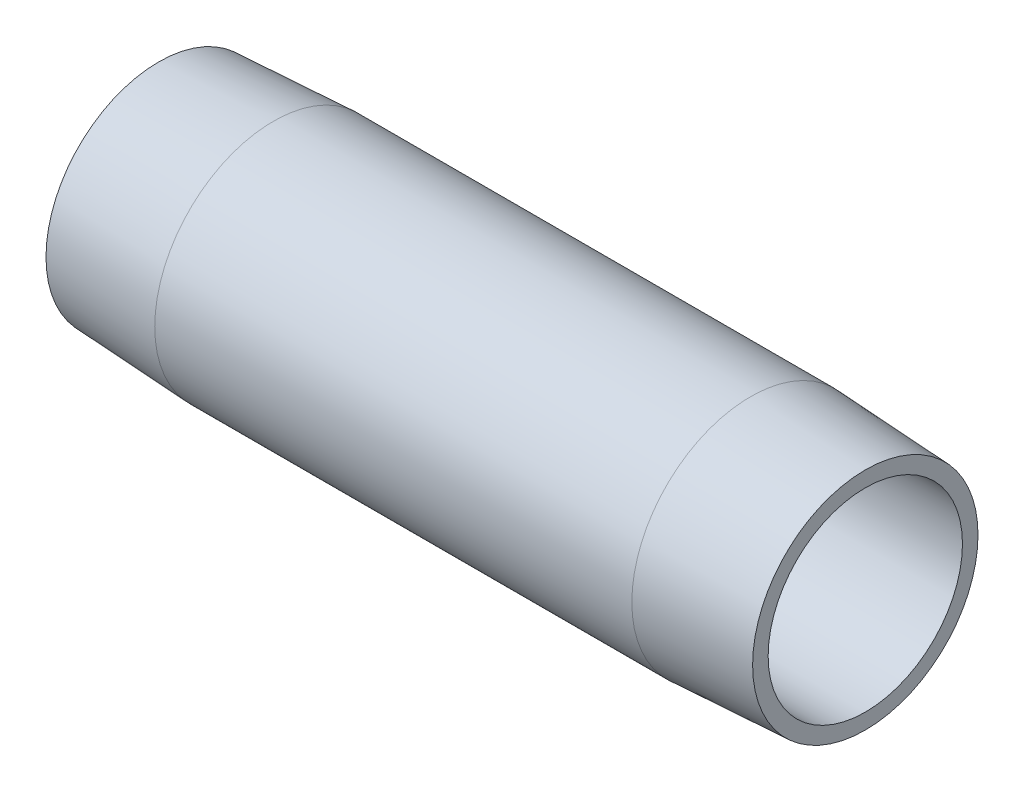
ISO-10303-21;
HEADER;
FILE_DESCRIPTION(('STEP AP214'),'2;1');
FILE_NAME('part.step','',(''),(''),'','','');
FILE_SCHEMA(('AUTOMOTIVE_DESIGN { 1 0 10303 214 1 1 1 1 }'));
ENDSEC;
DATA;
#1=APPLICATION_CONTEXT('core data for automotive mechanical design processes');
#2=APPLICATION_PROTOCOL_DEFINITION('international standard','automotive_design',2000,#1);
#3=PRODUCT_CONTEXT('',#1,'mechanical');
#4=PRODUCT('Part','Part','',(#3));
#5=PRODUCT_RELATED_PRODUCT_CATEGORY('part','',(#4));
#6=PRODUCT_DEFINITION_FORMATION('','',#4);
#7=PRODUCT_DEFINITION_CONTEXT('part definition',#1,'design');
#8=PRODUCT_DEFINITION('design','',#6,#7);
#9=PRODUCT_DEFINITION_SHAPE('','',#8);
#10=(LENGTH_UNIT() NAMED_UNIT(*) SI_UNIT(.MILLI.,.METRE.));
#11=(NAMED_UNIT(*) PLANE_ANGLE_UNIT() SI_UNIT($,.RADIAN.));
#12=(NAMED_UNIT(*) SI_UNIT($,.STERADIAN.) SOLID_ANGLE_UNIT());
#13=UNCERTAINTY_MEASURE_WITH_UNIT(LENGTH_MEASURE(1.E-05),#10,'distance_accuracy_value','');
#14=(GEOMETRIC_REPRESENTATION_CONTEXT(3) GLOBAL_UNCERTAINTY_ASSIGNED_CONTEXT((#13)) GLOBAL_UNIT_ASSIGNED_CONTEXT((#10,
#11,#12)) REPRESENTATION_CONTEXT('',''));
#15=CARTESIAN_POINT('',(0.,0.,0.));
#16=DIRECTION('',(0.,0.,1.));
#17=DIRECTION('',(1.,0.,0.));
#18=AXIS2_PLACEMENT_3D('',#15,#16,#17);
#19=CARTESIAN_POINT('',(63.5,8.73125,0.));
#20=DIRECTION('',(-1.,0.,0.));
#21=DIRECTION('',(0.,0.,1.));
#22=AXIS2_PLACEMENT_3D('',#19,#20,#21);
#23=PLANE('',#22);
#24=CARTESIAN_POINT('',(63.5,0.,0.));
#25=DIRECTION('',(-1.,0.,0.));
#26=DIRECTION('',(0.,0.,1.));
#27=AXIS2_PLACEMENT_3D('',#24,#25,#26);
#28=CIRCLE('',#27,10.1275500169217);
#29=CARTESIAN_POINT('',(63.5,0.,10.1275500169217));
#30=VERTEX_POINT('',#29);
#31=EDGE_CURVE('E10',#30,#30,#28,.T.);
#32=ORIENTED_EDGE('',*,*,#31,.F.);
#33=EDGE_LOOP('',(#32));
#34=FACE_BOUND('',#33,.T.);
#35=CARTESIAN_POINT('',(63.5,0.,0.));
#36=DIRECTION('',(-1.,0.,0.));
#37=DIRECTION('',(0.,0.,1.));
#38=AXIS2_PLACEMENT_3D('',#35,#36,#37);
#39=CIRCLE('',#38,8.73125);
#40=CARTESIAN_POINT('',(63.5,0.,8.73125));
#41=VERTEX_POINT('',#40);
#42=EDGE_CURVE('E52',#41,#41,#39,.T.);
#43=ORIENTED_EDGE('',*,*,#42,.T.);
#44=EDGE_LOOP('',(#43));
#45=FACE_BOUND('',#44,.T.);
#46=ADVANCED_FACE('F30',(#34,#45),#23,.F.);
#47=CARTESIAN_POINT('',(63.5,0.,0.));
#48=DIRECTION('',(-1.,0.,0.));
#49=DIRECTION('',(0.,0.,1.));
#50=AXIS2_PLACEMENT_3D('',#47,#48,#49);
#51=CONICAL_SURFACE('',#50,10.1275500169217,0.0523598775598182);
#52=CARTESIAN_POINT('',(53.1876,0.,0.));
#53=DIRECTION('',(-1.,0.,0.));
#54=DIRECTION('',(0.,0.,1.));
#55=AXIS2_PLACEMENT_3D('',#52,#53,#54);
#56=CIRCLE('',#55,10.668);
#57=CARTESIAN_POINT('',(53.1876,0.,10.668));
#58=VERTEX_POINT('',#57);
#59=EDGE_CURVE('E36',#58,#58,#56,.T.);
#60=ORIENTED_EDGE('',*,*,#59,.F.);
#61=EDGE_LOOP('',(#60));
#62=FACE_BOUND('',#61,.T.);
#63=ORIENTED_EDGE('',*,*,#31,.T.);
#64=EDGE_LOOP('',(#63));
#65=FACE_BOUND('',#64,.T.);
#66=ADVANCED_FACE('F77',(#62,#65),#51,.T.);
#67=CARTESIAN_POINT('',(0.,0.,0.));
#68=DIRECTION('',(-1.,0.,0.));
#69=DIRECTION('',(0.,0.,1.));
#70=AXIS2_PLACEMENT_3D('',#67,#68,#69);
#71=CYLINDRICAL_SURFACE('',#70,10.668);
#72=CARTESIAN_POINT('',(10.3124,0.,0.));
#73=DIRECTION('',(-1.,0.,0.));
#74=DIRECTION('',(0.,0.,1.));
#75=AXIS2_PLACEMENT_3D('',#72,#73,#74);
#76=CIRCLE('',#75,10.668);
#77=CARTESIAN_POINT('',(10.3124,0.,10.668));
#78=VERTEX_POINT('',#77);
#79=EDGE_CURVE('E40',#78,#78,#76,.T.);
#80=ORIENTED_EDGE('',*,*,#79,.F.);
#81=EDGE_LOOP('',(#80));
#82=FACE_BOUND('',#81,.T.);
#83=ORIENTED_EDGE('',*,*,#59,.T.);
#84=EDGE_LOOP('',(#83));
#85=FACE_BOUND('',#84,.T.);
#86=ADVANCED_FACE('F72',(#82,#85),#71,.T.);
#87=CARTESIAN_POINT('',(10.3124,0.,0.));
#88=DIRECTION('',(1.,0.,0.));
#89=DIRECTION('',(0.,0.,-1.));
#90=AXIS2_PLACEMENT_3D('',#87,#88,#89);
#91=CONICAL_SURFACE('',#90,10.668,0.0523598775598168);
#92=CARTESIAN_POINT('',(0.,0.,0.));
#93=DIRECTION('',(-1.,0.,0.));
#94=DIRECTION('',(0.,0.,1.));
#95=AXIS2_PLACEMENT_3D('',#92,#93,#94);
#96=CIRCLE('',#95,10.1275500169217);
#97=CARTESIAN_POINT('',(0.,0.,10.1275500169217));
#98=VERTEX_POINT('',#97);
#99=EDGE_CURVE('E44',#98,#98,#96,.T.);
#100=ORIENTED_EDGE('',*,*,#99,.F.);
#101=EDGE_LOOP('',(#100));
#102=FACE_BOUND('',#101,.T.);
#103=ORIENTED_EDGE('',*,*,#79,.T.);
#104=EDGE_LOOP('',(#103));
#105=FACE_BOUND('',#104,.T.);
#106=ADVANCED_FACE('F66',(#102,#105),#91,.T.);
#107=CARTESIAN_POINT('',(0.,10.1275500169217,0.));
#108=DIRECTION('',(1.,0.,0.));
#109=DIRECTION('',(0.,0.,-1.));
#110=AXIS2_PLACEMENT_3D('',#107,#108,#109);
#111=PLANE('',#110);
#112=CARTESIAN_POINT('',(0.,0.,0.));
#113=DIRECTION('',(-1.,0.,0.));
#114=DIRECTION('',(0.,0.,1.));
#115=AXIS2_PLACEMENT_3D('',#112,#113,#114);
#116=CIRCLE('',#115,8.73125);
#117=CARTESIAN_POINT('',(0.,0.,8.73125));
#118=VERTEX_POINT('',#117);
#119=EDGE_CURVE('E49',#118,#118,#116,.T.);
#120=ORIENTED_EDGE('',*,*,#119,.F.);
#121=EDGE_LOOP('',(#120));
#122=FACE_BOUND('',#121,.T.);
#123=ORIENTED_EDGE('',*,*,#99,.T.);
#124=EDGE_LOOP('',(#123));
#125=FACE_BOUND('',#124,.T.);
#126=ADVANCED_FACE('F60',(#122,#125),#111,.F.);
#127=CARTESIAN_POINT('',(0.,0.,0.));
#128=DIRECTION('',(-1.,0.,0.));
#129=DIRECTION('',(0.,0.,1.));
#130=AXIS2_PLACEMENT_3D('',#127,#128,#129);
#131=CYLINDRICAL_SURFACE('',#130,8.73125);
#132=ORIENTED_EDGE('',*,*,#42,.F.);
#133=EDGE_LOOP('',(#132));
#134=FACE_BOUND('',#133,.T.);
#135=ORIENTED_EDGE('',*,*,#119,.T.);
#136=EDGE_LOOP('',(#135));
#137=FACE_BOUND('',#136,.T.);
#138=ADVANCED_FACE('F57',(#134,#137),#131,.F.);
#139=CLOSED_SHELL('',(#46,#66,#86,#106,#126,#138));
#140=MANIFOLD_SOLID_BREP('B2',#139);
#141=ADVANCED_BREP_SHAPE_REPRESENTATION('',(#18,#140),#14);
#142=SHAPE_DEFINITION_REPRESENTATION(#9,#141);
ENDSEC;
END-ISO-10303-21;
